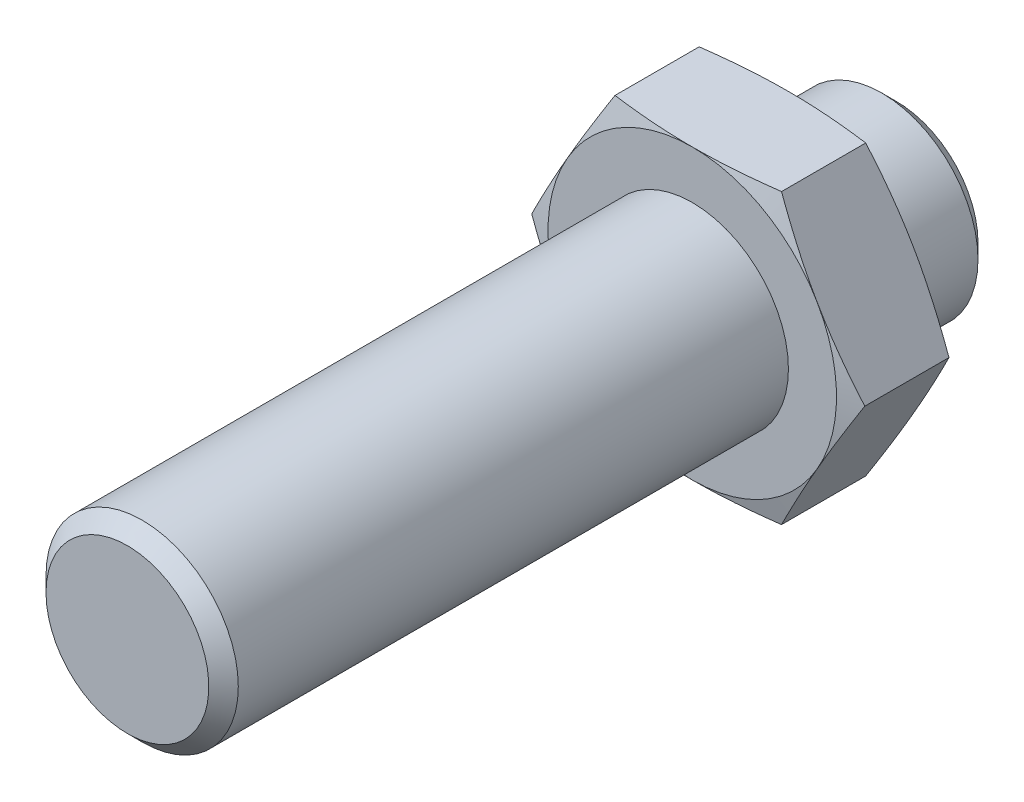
ISO-10303-21;
HEADER;
FILE_DESCRIPTION(('STEP AP214'),'2;1');
FILE_NAME('part.step','',(''),(''),'','','');
FILE_SCHEMA(('AUTOMOTIVE_DESIGN { 1 0 10303 214 1 1 1 1 }'));
ENDSEC;
DATA;
#1=APPLICATION_CONTEXT('core data for automotive mechanical design processes');
#2=APPLICATION_PROTOCOL_DEFINITION('international standard','automotive_design',2000,#1);
#3=PRODUCT_CONTEXT('',#1,'mechanical');
#4=PRODUCT('Part','Part','',(#3));
#5=PRODUCT_RELATED_PRODUCT_CATEGORY('part','',(#4));
#6=PRODUCT_DEFINITION_FORMATION('','',#4);
#7=PRODUCT_DEFINITION_CONTEXT('part definition',#1,'design');
#8=PRODUCT_DEFINITION('design','',#6,#7);
#9=PRODUCT_DEFINITION_SHAPE('','',#8);
#10=(LENGTH_UNIT() NAMED_UNIT(*) SI_UNIT(.MILLI.,.METRE.));
#11=(NAMED_UNIT(*) PLANE_ANGLE_UNIT() SI_UNIT($,.RADIAN.));
#12=(NAMED_UNIT(*) SI_UNIT($,.STERADIAN.) SOLID_ANGLE_UNIT());
#13=UNCERTAINTY_MEASURE_WITH_UNIT(LENGTH_MEASURE(1.E-05),#10,'distance_accuracy_value','');
#14=(GEOMETRIC_REPRESENTATION_CONTEXT(3) GLOBAL_UNCERTAINTY_ASSIGNED_CONTEXT((#13)) GLOBAL_UNIT_ASSIGNED_CONTEXT((#10,
#11,#12)) REPRESENTATION_CONTEXT('',''));
#15=CARTESIAN_POINT('',(0.,0.,0.));
#16=DIRECTION('',(0.,0.,1.));
#17=DIRECTION('',(1.,0.,0.));
#18=AXIS2_PLACEMENT_3D('',#15,#16,#17);
#19=CARTESIAN_POINT('',(0.,3.3865,0.));
#20=DIRECTION('',(0.,0.,1.));
#21=DIRECTION('',(1.,0.,0.));
#22=AXIS2_PLACEMENT_3D('',#19,#20,#21);
#23=PLANE('',#22);
#24=CARTESIAN_POINT('',(0.,0.,0.));
#25=DIRECTION('',(0.,0.,1.));
#26=DIRECTION('',(1.,0.,0.));
#27=AXIS2_PLACEMENT_3D('',#24,#25,#26);
#28=CIRCLE('',#27,3.38650000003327);
#29=CARTESIAN_POINT('',(3.38650000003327,0.,0.));
#30=VERTEX_POINT('',#29);
#31=EDGE_CURVE('E20',#30,#30,#28,.T.);
#32=ORIENTED_EDGE('',*,*,#31,.F.);
#33=EDGE_LOOP('',(#32));
#34=FACE_BOUND('',#33,.T.);
#35=ADVANCED_FACE('F17',(#34),#23,.F.);
#36=CARTESIAN_POINT('',(0.,0.,0.613499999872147));
#37=DIRECTION('',(0.,0.,1.));
#38=DIRECTION('',(1.,0.,0.));
#39=AXIS2_PLACEMENT_3D('',#36,#37,#38);
#40=CONICAL_SURFACE('',#39,3.99999999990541,0.785398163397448);
#41=CARTESIAN_POINT('',(0.,0.,0.613500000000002));
#42=DIRECTION('',(0.,0.,1.));
#43=DIRECTION('',(1.,0.,0.));
#44=AXIS2_PLACEMENT_3D('',#41,#42,#43);
#45=CIRCLE('',#44,4.);
#46=CARTESIAN_POINT('',(4.,0.,0.613500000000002));
#47=VERTEX_POINT('',#46);
#48=EDGE_CURVE('E371',#47,#47,#45,.T.);
#49=ORIENTED_EDGE('',*,*,#48,.F.);
#50=EDGE_LOOP('',(#49));
#51=FACE_BOUND('',#50,.T.);
#52=ORIENTED_EDGE('',*,*,#31,.T.);
#53=EDGE_LOOP('',(#52));
#54=FACE_BOUND('',#53,.T.);
#55=ADVANCED_FACE('F408',(#51,#54),#40,.T.);
#56=CARTESIAN_POINT('',(0.,0.,0.));
#57=DIRECTION('',(0.,0.,1.));
#58=DIRECTION('',(1.,0.,0.));
#59=AXIS2_PLACEMENT_3D('',#56,#57,#58);
#60=CYLINDRICAL_SURFACE('',#59,4.);
#61=CARTESIAN_POINT('',(0.,0.,4.5));
#62=DIRECTION('',(0.,0.,1.));
#63=DIRECTION('',(1.,0.,0.));
#64=AXIS2_PLACEMENT_3D('',#61,#62,#63);
#65=CIRCLE('',#64,4.);
#66=CARTESIAN_POINT('',(4.,0.,4.5));
#67=VERTEX_POINT('',#66);
#68=EDGE_CURVE('E125',#67,#67,#65,.F.);
#69=ORIENTED_EDGE('',*,*,#68,.T.);
#70=EDGE_LOOP('',(#69));
#71=FACE_BOUND('',#70,.T.);
#72=ORIENTED_EDGE('',*,*,#48,.T.);
#73=EDGE_LOOP('',(#72));
#74=FACE_BOUND('',#73,.T.);
#75=ADVANCED_FACE('F400',(#71,#74),#60,.T.);
#76=CARTESIAN_POINT('',(0.,4.,4.5));
#77=DIRECTION('',(0.,0.,1.));
#78=DIRECTION('',(1.,0.,0.));
#79=AXIS2_PLACEMENT_3D('',#76,#77,#78);
#80=PLANE('',#79);
#81=ORIENTED_EDGE('',*,*,#68,.F.);
#82=EDGE_LOOP('',(#81));
#83=FACE_BOUND('',#82,.T.);
#84=CARTESIAN_POINT('',(0.,0.,4.50000000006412));
#85=DIRECTION('',(0.,0.,1.));
#86=DIRECTION('',(1.,0.,0.));
#87=AXIS2_PLACEMENT_3D('',#84,#85,#86);
#88=CIRCLE('',#87,6.00000000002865);
#89=CARTESIAN_POINT('',(5.19615242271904,-3.00000000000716,4.50000000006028));
#90=VERTEX_POINT('',#89);
#91=CARTESIAN_POINT('',(5.19615242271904,3.00000000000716,4.50000000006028));
#92=VERTEX_POINT('',#91);
#93=EDGE_CURVE('E106',#90,#92,#88,.T.);
#94=ORIENTED_EDGE('',*,*,#93,.F.);
#95=CARTESIAN_POINT('',(0.,0.,4.50000000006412));
#96=DIRECTION('',(0.,0.,1.));
#97=DIRECTION('',(1.,0.,0.));
#98=AXIS2_PLACEMENT_3D('',#95,#96,#97);
#99=CIRCLE('',#98,6.00000000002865);
#100=CARTESIAN_POINT('',(0.,-6.00000000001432,4.50000000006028));
#101=VERTEX_POINT('',#100);
#102=EDGE_CURVE('E103',#101,#90,#99,.T.);
#103=ORIENTED_EDGE('',*,*,#102,.F.);
#104=CARTESIAN_POINT('',(0.,0.,4.50000000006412));
#105=DIRECTION('',(0.,0.,1.));
#106=DIRECTION('',(1.,0.,0.));
#107=AXIS2_PLACEMENT_3D('',#104,#105,#106);
#108=CIRCLE('',#107,6.00000000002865);
#109=CARTESIAN_POINT('',(-5.19615242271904,-3.00000000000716,4.50000000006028));
#110=VERTEX_POINT('',#109);
#111=EDGE_CURVE('E124',#110,#101,#108,.T.);
#112=ORIENTED_EDGE('',*,*,#111,.F.);
#113=CARTESIAN_POINT('',(0.,0.,4.50000000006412));
#114=DIRECTION('',(0.,0.,1.));
#115=DIRECTION('',(1.,0.,0.));
#116=AXIS2_PLACEMENT_3D('',#113,#114,#115);
#117=CIRCLE('',#116,6.00000000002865);
#118=CARTESIAN_POINT('',(-5.19615242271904,3.00000000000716,4.50000000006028));
#119=VERTEX_POINT('',#118);
#120=EDGE_CURVE('E393',#119,#110,#117,.T.);
#121=ORIENTED_EDGE('',*,*,#120,.F.);
#122=CARTESIAN_POINT('',(0.,0.,4.50000000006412));
#123=DIRECTION('',(0.,0.,1.));
#124=DIRECTION('',(1.,0.,0.));
#125=AXIS2_PLACEMENT_3D('',#122,#123,#124);
#126=CIRCLE('',#125,6.00000000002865);
#127=CARTESIAN_POINT('',(0.,6.00000000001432,4.50000000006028));
#128=VERTEX_POINT('',#127);
#129=EDGE_CURVE('E113',#128,#119,#126,.T.);
#130=ORIENTED_EDGE('',*,*,#129,.F.);
#131=CARTESIAN_POINT('',(0.,0.,4.50000000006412));
#132=DIRECTION('',(0.,0.,1.));
#133=DIRECTION('',(1.,0.,0.));
#134=AXIS2_PLACEMENT_3D('',#131,#132,#133);
#135=CIRCLE('',#134,6.00000000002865);
#136=EDGE_CURVE('E109',#92,#128,#135,.T.);
#137=ORIENTED_EDGE('',*,*,#136,.F.);
#138=EDGE_LOOP('',(#94,#103,#112,#121,#130,#137));
#139=FACE_BOUND('',#138,.T.);
#140=ADVANCED_FACE('F107',(#83,#139),#80,.F.);
#141=CARTESIAN_POINT('',(0.,0.,4.75020357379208));
#142=DIRECTION('',(0.,0.,1.));
#143=DIRECTION('',(1.,0.,0.));
#144=AXIS2_PLACEMENT_3D('',#141,#142,#143);
#145=CONICAL_SURFACE('',#144,6.93377244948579,1.30899693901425);
#146=CARTESIAN_POINT('',(0.,-6.,4.50000000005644));
#147=CARTESIAN_POINT('',(0.144925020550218,-6.,4.49999340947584));
#148=CARTESIAN_POINT('',(0.289845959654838,-6.,4.50140757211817));
#149=CARTESIAN_POINT('',(0.579629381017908,-6.,4.5070216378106));
#150=CARTESIAN_POINT('',(0.724491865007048,-6.,4.51122145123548));
#151=CARTESIAN_POINT('',(1.15859244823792,-6.,4.52790288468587));
#152=CARTESIAN_POINT('',(1.44768188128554,-6.,4.54446674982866));
#153=CARTESIAN_POINT('',(2.02502964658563,-6.,4.58746786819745));
#154=CARTESIAN_POINT('',(2.31328815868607,-6.,4.61390279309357));
#155=CARTESIAN_POINT('',(2.88923748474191,-6.,4.67527616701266));
#156=CARTESIAN_POINT('',(3.17692727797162,-6.,4.71022426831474));
#157=CARTESIAN_POINT('',(3.46410161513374,-6.,4.74871130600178));
#158=B_SPLINE_CURVE_WITH_KNOTS('',3,(#146,#147,#148,#149,#150,#151,#152,#153,#154,#155,#156,
#157),.UNSPECIFIED.,.F.,.F.,(4,2,2,2,2,4),(0.,0.434760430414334,0.869506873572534,
1.73798582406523,2.6062600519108,3.47552335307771),.UNSPECIFIED.);
#159=CARTESIAN_POINT('',(3.464101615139,-5.99999999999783,4.74871130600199));
#160=VERTEX_POINT('',#159);
#161=EDGE_CURVE('E122',#101,#160,#158,.T.);
#162=ORIENTED_EDGE('',*,*,#161,.F.);
#163=ORIENTED_EDGE('',*,*,#102,.T.);
#164=CARTESIAN_POINT('',(3.46410161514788,-6.00000000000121,4.74871130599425));
#165=CARTESIAN_POINT('',(3.60768878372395,-5.75129972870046,4.71022426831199));
#166=CARTESIAN_POINT('',(3.75153368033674,-5.5021530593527,4.67527616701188));
#167=CARTESIAN_POINT('',(4.03950834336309,-5.00336631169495,4.61390279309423));
#168=CARTESIAN_POINT('',(4.1836375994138,-4.75372711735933,4.5874678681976));
#169=CARTESIAN_POINT('',(4.47231148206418,-4.25372928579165,4.54446674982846));
#170=CARTESIAN_POINT('',(4.61685619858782,-4.00337049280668,4.52790288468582));
#171=CARTESIAN_POINT('',(4.83390649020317,-3.62742835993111,4.51122145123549));
#172=CARTESIAN_POINT('',(4.90633773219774,-3.50197376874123,4.5070216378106));
#173=CARTESIAN_POINT('',(5.05122944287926,-3.25101396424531,4.50140757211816));
#174=CARTESIAN_POINT('',(5.12368991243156,-3.12550874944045,4.49999340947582));
#175=CARTESIAN_POINT('',(5.19615242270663,-3.,4.50000000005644));
#176=B_SPLINE_CURVE_WITH_KNOTS('',3,(#164,#165,#166,#167,#168,#169,#170,#171,#172,#173,#174,
#175),.UNSPECIFIED.,.F.,.F.,(4,2,2,2,2,4),(0.,0.869263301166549,1.73753752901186,
2.60601647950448,3.04076292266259,3.47552335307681),.UNSPECIFIED.);
#177=EDGE_CURVE('E119',#160,#90,#176,.T.);
#178=ORIENTED_EDGE('',*,*,#177,.F.);
#179=EDGE_LOOP('',(#162,#163,#178));
#180=FACE_BOUND('',#179,.T.);
#181=ADVANCED_FACE('F117',(#180),#145,.T.);
#182=CARTESIAN_POINT('',(0.,0.,4.75020357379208));
#183=DIRECTION('',(0.,0.,1.));
#184=DIRECTION('',(1.,0.,0.));
#185=AXIS2_PLACEMENT_3D('',#182,#183,#184);
#186=CONICAL_SURFACE('',#185,6.93377244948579,1.30899693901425);
#187=CARTESIAN_POINT('',(-5.19615242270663,-3.,4.50000000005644));
#188=CARTESIAN_POINT('',(-5.12368991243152,-3.12550874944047,4.49999340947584));
#189=CARTESIAN_POINT('',(-5.05122944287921,-3.25101396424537,4.50140757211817));
#190=CARTESIAN_POINT('',(-4.90633773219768,-3.50197376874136,4.5070216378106));
#191=CARTESIAN_POINT('',(-4.83390649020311,-3.62742835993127,4.51122145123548));
#192=CARTESIAN_POINT('',(-4.61685619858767,-4.00337049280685,4.52790288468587));
#193=CARTESIAN_POINT('',(-4.47231148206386,-4.25372928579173,4.54446674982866));
#194=CARTESIAN_POINT('',(-4.18363759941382,-4.75372711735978,4.58746786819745));
#195=CARTESIAN_POINT('',(-4.03950834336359,-5.00336631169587,4.61390279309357));
#196=CARTESIAN_POINT('',(-3.75153368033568,-5.50215305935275,4.67527616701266));
#197=CARTESIAN_POINT('',(-3.60768878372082,-5.75129972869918,4.71022426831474));
#198=CARTESIAN_POINT('',(-3.46410161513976,-5.99999999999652,4.74871130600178));
#199=B_SPLINE_CURVE_WITH_KNOTS('',3,(#187,#188,#189,#190,#191,#192,#193,#194,#195,#196,#197,
#198),.UNSPECIFIED.,.F.,.F.,(4,2,2,2,2,4),(0.,0.434760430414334,0.869506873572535,
1.73798582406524,2.60626005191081,3.47552335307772),.UNSPECIFIED.);
#200=CARTESIAN_POINT('',(-3.46410161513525,-6.,4.74871130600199));
#201=VERTEX_POINT('',#200);
#202=EDGE_CURVE('E378',#110,#201,#199,.T.);
#203=ORIENTED_EDGE('',*,*,#202,.F.);
#204=ORIENTED_EDGE('',*,*,#111,.T.);
#205=CARTESIAN_POINT('',(-3.46410161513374,-6.00000000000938,4.74871130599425));
#206=CARTESIAN_POINT('',(-3.17692727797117,-6.00000000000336,4.71022426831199));
#207=CARTESIAN_POINT('',(-2.88923748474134,-6.0000000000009,4.67527616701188));
#208=CARTESIAN_POINT('',(-2.31328815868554,-5.9999999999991,4.61390279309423));
#209=CARTESIAN_POINT('',(-2.02502964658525,-5.99999999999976,4.5874678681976));
#210=CARTESIAN_POINT('',(-1.44768188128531,-6.00000000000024,4.54446674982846));
#211=CARTESIAN_POINT('',(-1.1585924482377,-6.00000000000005,4.52790288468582));
#212=CARTESIAN_POINT('',(-0.724491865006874,-5.99999999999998,4.51122145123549));
#213=CARTESIAN_POINT('',(-0.579629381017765,-5.99999999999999,4.5070216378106));
#214=CARTESIAN_POINT('',(-0.289845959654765,-6.00000000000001,4.50140757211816));
#215=CARTESIAN_POINT('',(-0.144925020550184,-6.00000000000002,4.49999340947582));
#216=CARTESIAN_POINT('',(0.,-6.,4.50000000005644));
#217=B_SPLINE_CURVE_WITH_KNOTS('',3,(#205,#206,#207,#208,#209,#210,#211,#212,#213,#214,#215,
#216),.UNSPECIFIED.,.F.,.F.,(4,2,2,2,2,4),(0.,0.869263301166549,1.73753752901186,
2.60601647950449,3.0407629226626,3.47552335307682),.UNSPECIFIED.);
#218=EDGE_CURVE('E134',#201,#101,#217,.T.);
#219=ORIENTED_EDGE('',*,*,#218,.F.);
#220=EDGE_LOOP('',(#203,#204,#219));
#221=FACE_BOUND('',#220,.T.);
#222=ADVANCED_FACE('F158',(#221),#186,.T.);
#223=CARTESIAN_POINT('',(0.,0.,4.75020357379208));
#224=DIRECTION('',(0.,0.,1.));
#225=DIRECTION('',(1.,0.,0.));
#226=AXIS2_PLACEMENT_3D('',#223,#224,#225);
#227=CONICAL_SURFACE('',#226,6.93377244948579,1.30899693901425);
#228=ORIENTED_EDGE('',*,*,#120,.T.);
#229=CARTESIAN_POINT('',(-6.92820323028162,-8.16341725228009E-12,4.74871130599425));
#230=CARTESIAN_POINT('',(-6.78461606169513,-0.248700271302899,4.71022426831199));
#231=CARTESIAN_POINT('',(-6.64077116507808,-0.497846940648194,4.67527616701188));
#232=CARTESIAN_POINT('',(-6.35279650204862,-0.996633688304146,4.61390279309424));
#233=CARTESIAN_POINT('',(-6.20866724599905,-1.24627288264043,4.5874678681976));
#234=CARTESIAN_POINT('',(-5.91999336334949,-1.74627071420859,4.54446674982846));
#235=CARTESIAN_POINT('',(-5.77544864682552,-1.99662950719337,4.52790288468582));
#236=CARTESIAN_POINT('',(-5.55839835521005,-2.37257164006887,4.51122145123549));
#237=CARTESIAN_POINT('',(-5.48596711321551,-2.49802623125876,4.5070216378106));
#238=CARTESIAN_POINT('',(-5.34107540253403,-2.7489860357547,4.50140757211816));
#239=CARTESIAN_POINT('',(-5.26861493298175,-2.87449125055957,4.49999340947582));
#240=CARTESIAN_POINT('',(-5.19615242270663,-3.,4.50000000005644));
#241=B_SPLINE_CURVE_WITH_KNOTS('',3,(#229,#230,#231,#232,#233,#234,#235,#236,#237,#238,#239,
#240),.UNSPECIFIED.,.F.,.F.,(4,2,2,2,2,4),(0.,0.869263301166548,1.73753752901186,
2.60601647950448,3.04076292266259,3.47552335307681),.UNSPECIFIED.);
#242=CARTESIAN_POINT('',(-6.92820323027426,-2.16671186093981E-12,4.74871130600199));
#243=VERTEX_POINT('',#242);
#244=EDGE_CURVE('E168',#243,#110,#241,.T.);
#245=ORIENTED_EDGE('',*,*,#244,.F.);
#246=CARTESIAN_POINT('',(-5.19615242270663,3.,4.50000000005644));
#247=CARTESIAN_POINT('',(-5.26861493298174,2.87449125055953,4.49999340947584));
#248=CARTESIAN_POINT('',(-5.34107540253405,2.74898603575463,4.50140757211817));
#249=CARTESIAN_POINT('',(-5.48596711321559,2.49802623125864,4.5070216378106));
#250=CARTESIAN_POINT('',(-5.55839835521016,2.37257164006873,4.51122145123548));
#251=CARTESIAN_POINT('',(-5.77544864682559,1.99662950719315,4.52790288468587));
#252=CARTESIAN_POINT('',(-5.9199933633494,1.74627071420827,4.54446674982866));
#253=CARTESIAN_POINT('',(-6.20866724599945,1.24627288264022,4.58746786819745));
#254=CARTESIAN_POINT('',(-6.35279650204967,0.996633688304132,4.61390279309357));
#255=CARTESIAN_POINT('',(-6.64077116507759,0.497846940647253,4.67527616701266));
#256=CARTESIAN_POINT('',(-6.78461606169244,0.248700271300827,4.71022426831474));
#257=CARTESIAN_POINT('',(-6.9282032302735,3.47812675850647E-12,4.74871130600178));
#258=B_SPLINE_CURVE_WITH_KNOTS('',3,(#246,#247,#248,#249,#250,#251,#252,#253,#254,#255,#256,
#257),.UNSPECIFIED.,.F.,.F.,(4,2,2,2,2,4),(0.,0.434760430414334,0.869506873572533,
1.73798582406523,2.6062600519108,3.47552335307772),.UNSPECIFIED.);
#259=EDGE_CURVE('E267',#119,#243,#258,.T.);
#260=ORIENTED_EDGE('',*,*,#259,.F.);
#261=EDGE_LOOP('',(#228,#245,#260));
#262=FACE_BOUND('',#261,.T.);
#263=ADVANCED_FACE('F501',(#262),#227,.T.);
#264=CARTESIAN_POINT('',(0.,0.,4.75020357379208));
#265=DIRECTION('',(0.,0.,1.));
#266=DIRECTION('',(1.,0.,0.));
#267=AXIS2_PLACEMENT_3D('',#264,#265,#266);
#268=CONICAL_SURFACE('',#267,6.93377244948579,1.30899693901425);
#269=ORIENTED_EDGE('',*,*,#129,.T.);
#270=CARTESIAN_POINT('',(-3.46410161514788,6.00000000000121,4.74871130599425));
#271=CARTESIAN_POINT('',(-3.60768878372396,5.75129972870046,4.71022426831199));
#272=CARTESIAN_POINT('',(-3.75153368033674,5.5021530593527,4.67527616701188));
#273=CARTESIAN_POINT('',(-4.03950834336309,5.00336631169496,4.61390279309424));
#274=CARTESIAN_POINT('',(-4.1836375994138,4.75372711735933,4.5874678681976));
#275=CARTESIAN_POINT('',(-4.47231148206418,4.25372928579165,4.54446674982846));
#276=CARTESIAN_POINT('',(-4.61685619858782,4.00337049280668,4.52790288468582));
#277=CARTESIAN_POINT('',(-4.83390649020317,3.62742835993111,4.51122145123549));
#278=CARTESIAN_POINT('',(-4.90633773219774,3.50197376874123,4.5070216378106));
#279=CARTESIAN_POINT('',(-5.05122944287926,3.25101396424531,4.50140757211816));
#280=CARTESIAN_POINT('',(-5.12368991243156,3.12550874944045,4.49999340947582));
#281=CARTESIAN_POINT('',(-5.19615242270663,3.,4.50000000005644));
#282=B_SPLINE_CURVE_WITH_KNOTS('',3,(#270,#271,#272,#273,#274,#275,#276,#277,#278,#279,#280,
#281),.UNSPECIFIED.,.F.,.F.,(4,2,2,2,2,4),(0.,0.869263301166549,1.73753752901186,
2.60601647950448,3.04076292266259,3.47552335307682),.UNSPECIFIED.);
#283=CARTESIAN_POINT('',(-3.464101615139,5.99999999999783,4.74871130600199));
#284=VERTEX_POINT('',#283);
#285=EDGE_CURVE('E377',#284,#119,#282,.T.);
#286=ORIENTED_EDGE('',*,*,#285,.F.);
#287=CARTESIAN_POINT('',(0.,6.,4.50000000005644));
#288=CARTESIAN_POINT('',(-0.144925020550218,6.,4.49999340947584));
#289=CARTESIAN_POINT('',(-0.289845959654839,6.,4.50140757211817));
#290=CARTESIAN_POINT('',(-0.579629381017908,6.,4.5070216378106));
#291=CARTESIAN_POINT('',(-0.724491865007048,6.,4.51122145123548));
#292=CARTESIAN_POINT('',(-1.15859244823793,6.,4.52790288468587));
#293=CARTESIAN_POINT('',(-1.44768188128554,6.,4.54446674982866));
#294=CARTESIAN_POINT('',(-2.02502964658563,6.,4.58746786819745));
#295=CARTESIAN_POINT('',(-2.31328815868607,6.,4.61390279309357));
#296=CARTESIAN_POINT('',(-2.88923748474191,6.,4.67527616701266));
#297=CARTESIAN_POINT('',(-3.17692727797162,6.,4.71022426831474));
#298=CARTESIAN_POINT('',(-3.46410161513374,6.,4.74871130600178));
#299=B_SPLINE_CURVE_WITH_KNOTS('',3,(#287,#288,#289,#290,#291,#292,#293,#294,#295,#296,#297,
#298),.UNSPECIFIED.,.F.,.F.,(4,2,2,2,2,4),(0.,0.434760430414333,0.869506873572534,
1.73798582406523,2.6062600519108,3.47552335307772),.UNSPECIFIED.);
#300=EDGE_CURVE('E262',#128,#284,#299,.T.);
#301=ORIENTED_EDGE('',*,*,#300,.F.);
#302=EDGE_LOOP('',(#269,#286,#301));
#303=FACE_BOUND('',#302,.T.);
#304=ADVANCED_FACE('F495',(#303),#268,.T.);
#305=CARTESIAN_POINT('',(0.,0.,4.75020357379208));
#306=DIRECTION('',(0.,0.,1.));
#307=DIRECTION('',(1.,0.,0.));
#308=AXIS2_PLACEMENT_3D('',#305,#306,#307);
#309=CONICAL_SURFACE('',#308,6.93377244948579,1.30899693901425);
#310=ORIENTED_EDGE('',*,*,#93,.T.);
#311=CARTESIAN_POINT('',(6.92820323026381,1.27161662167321E-11,4.74871130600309));
#312=CARTESIAN_POINT('',(6.78461606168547,0.248700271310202,4.71022426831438));
#313=CARTESIAN_POINT('',(6.64077116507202,0.497846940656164,4.67527616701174));
#314=CARTESIAN_POINT('',(6.35279650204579,0.996633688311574,4.61390279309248));
#315=CARTESIAN_POINT('',(6.20866724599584,1.24627288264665,4.58746786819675));
#316=CARTESIAN_POINT('',(5.91999336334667,1.74627071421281,4.54446674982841));
#317=CARTESIAN_POINT('',(5.77544864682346,1.9966295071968,4.52790288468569));
#318=CARTESIAN_POINT('',(5.55839835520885,2.37257164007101,4.51122145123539));
#319=CARTESIAN_POINT('',(5.48596711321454,2.49802623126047,4.50702163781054));
#320=CARTESIAN_POINT('',(5.34107540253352,2.74898603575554,4.50140757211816));
#321=CARTESIAN_POINT('',(5.26861493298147,2.87449125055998,4.49999340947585));
#322=CARTESIAN_POINT('',(5.19615242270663,3.,4.50000000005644));
#323=B_SPLINE_CURVE_WITH_KNOTS('',3,(#311,#312,#313,#314,#315,#316,#317,#318,#319,#320,#321,
#322),.UNSPECIFIED.,.F.,.F.,(4,2,2,2,2,4),(0.,0.869263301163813,1.73753752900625,
2.60601647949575,3.04076292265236,3.47552335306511),.UNSPECIFIED.);
#324=CARTESIAN_POINT('',(6.92820323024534,0.,4.74871130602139));
#325=VERTEX_POINT('',#324);
#326=EDGE_CURVE('E131',#325,#92,#323,.T.);
#327=ORIENTED_EDGE('',*,*,#326,.F.);
#328=CARTESIAN_POINT('',(5.19615242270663,-3.,4.50000000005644));
#329=CARTESIAN_POINT('',(5.26861493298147,-2.87449125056,4.49999340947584));
#330=CARTESIAN_POINT('',(5.34107540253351,-2.74898603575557,4.50140757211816));
#331=CARTESIAN_POINT('',(5.4859671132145,-2.49802623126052,4.50702163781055));
#332=CARTESIAN_POINT('',(5.5583983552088,-2.37257164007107,4.51122145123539));
#333=CARTESIAN_POINT('',(5.77544864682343,-1.99662950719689,4.52790288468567));
#334=CARTESIAN_POINT('',(5.91999336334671,-1.74627071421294,4.54446674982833));
#335=CARTESIAN_POINT('',(6.20866724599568,-1.24627288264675,4.58746786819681));
#336=CARTESIAN_POINT('',(6.35279650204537,-0.996633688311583,4.61390279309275));
#337=CARTESIAN_POINT('',(6.64077116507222,-0.497846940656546,4.67527616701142));
#338=CARTESIAN_POINT('',(6.78461606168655,-0.248700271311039,4.71022426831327));
#339=CARTESIAN_POINT('',(6.92820323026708,-1.46054919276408E-11,4.74871130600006));
#340=B_SPLINE_CURVE_WITH_KNOTS('',3,(#328,#329,#330,#331,#332,#333,#334,#335,#336,#337,#338,
#339),.UNSPECIFIED.,.F.,.F.,(4,2,2,2,2,4),(0.,0.43476043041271,0.869506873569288,
1.73798582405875,2.60626005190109,3.47552335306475),.UNSPECIFIED.);
#341=EDGE_CURVE('E128',#90,#325,#340,.T.);
#342=ORIENTED_EDGE('',*,*,#341,.F.);
#343=EDGE_LOOP('',(#310,#327,#342));
#344=FACE_BOUND('',#343,.T.);
#345=ADVANCED_FACE('F129',(#344),#309,.T.);
#346=CARTESIAN_POINT('',(0.,0.,4.75020357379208));
#347=DIRECTION('',(0.,0.,1.));
#348=DIRECTION('',(1.,0.,0.));
#349=AXIS2_PLACEMENT_3D('',#346,#347,#348);
#350=CONICAL_SURFACE('',#349,6.93377244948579,1.30899693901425);
#351=ORIENTED_EDGE('',*,*,#136,.T.);
#352=CARTESIAN_POINT('',(3.46410161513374,6.00000000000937,4.74871130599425));
#353=CARTESIAN_POINT('',(3.17692727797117,6.00000000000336,4.71022426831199));
#354=CARTESIAN_POINT('',(2.88923748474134,6.0000000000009,4.67527616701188));
#355=CARTESIAN_POINT('',(2.31328815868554,5.9999999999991,4.61390279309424));
#356=CARTESIAN_POINT('',(2.02502964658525,5.99999999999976,4.5874678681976));
#357=CARTESIAN_POINT('',(1.44768188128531,6.00000000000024,4.54446674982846));
#358=CARTESIAN_POINT('',(1.1585924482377,6.00000000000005,4.52790288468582));
#359=CARTESIAN_POINT('',(0.724491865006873,5.99999999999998,4.51122145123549));
#360=CARTESIAN_POINT('',(0.579629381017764,5.99999999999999,4.5070216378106));
#361=CARTESIAN_POINT('',(0.289845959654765,6.00000000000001,4.50140757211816));
#362=CARTESIAN_POINT('',(0.144925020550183,6.00000000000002,4.49999340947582));
#363=CARTESIAN_POINT('',(0.,6.,4.50000000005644));
#364=B_SPLINE_CURVE_WITH_KNOTS('',3,(#352,#353,#354,#355,#356,#357,#358,#359,#360,#361,#362,
#363),.UNSPECIFIED.,.F.,.F.,(4,2,2,2,2,4),(0.,0.869263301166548,1.73753752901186,
2.60601647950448,3.0407629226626,3.47552335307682),.UNSPECIFIED.);
#365=CARTESIAN_POINT('',(3.46410161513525,6.,4.74871130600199));
#366=VERTEX_POINT('',#365);
#367=EDGE_CURVE('E256',#366,#128,#364,.T.);
#368=ORIENTED_EDGE('',*,*,#367,.F.);
#369=CARTESIAN_POINT('',(5.19615242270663,3.,4.50000000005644));
#370=CARTESIAN_POINT('',(5.12368991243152,3.12550874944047,4.49999340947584));
#371=CARTESIAN_POINT('',(5.05122944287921,3.25101396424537,4.50140757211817));
#372=CARTESIAN_POINT('',(4.90633773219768,3.50197376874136,4.5070216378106));
#373=CARTESIAN_POINT('',(4.83390649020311,3.62742835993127,4.51122145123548));
#374=CARTESIAN_POINT('',(4.61685619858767,4.00337049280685,4.52790288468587));
#375=CARTESIAN_POINT('',(4.47231148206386,4.25372928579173,4.54446674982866));
#376=CARTESIAN_POINT('',(4.18363759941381,4.75372711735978,4.58746786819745));
#377=CARTESIAN_POINT('',(4.03950834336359,5.00336631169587,4.61390279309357));
#378=CARTESIAN_POINT('',(3.75153368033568,5.50215305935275,4.67527616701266));
#379=CARTESIAN_POINT('',(3.60768878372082,5.75129972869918,4.71022426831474));
#380=CARTESIAN_POINT('',(3.46410161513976,5.99999999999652,4.74871130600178));
#381=B_SPLINE_CURVE_WITH_KNOTS('',3,(#369,#370,#371,#372,#373,#374,#375,#376,#377,#378,#379,
#380),.UNSPECIFIED.,.F.,.F.,(4,2,2,2,2,4),(0.,0.434760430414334,0.869506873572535,
1.73798582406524,2.60626005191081,3.47552335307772),.UNSPECIFIED.);
#382=EDGE_CURVE('E237',#92,#366,#381,.T.);
#383=ORIENTED_EDGE('',*,*,#382,.F.);
#384=EDGE_LOOP('',(#351,#368,#383));
#385=FACE_BOUND('',#384,.T.);
#386=ADVANCED_FACE('F248',(#385),#350,.T.);
#387=CARTESIAN_POINT('',(3.46410161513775,-6.,4.5));
#388=DIRECTION('',(0.866025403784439,-0.5,0.));
#389=DIRECTION('',(0.5,0.866025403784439,0.));
#390=AXIS2_PLACEMENT_3D('',#387,#388,#389);
#391=PLANE('',#390);
#392=CARTESIAN_POINT('',(3.46410166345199,-5.99999991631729,8.25128870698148));
#393=CARTESIAN_POINT('',(3.60768882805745,-5.75129965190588,8.28977574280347));
#394=CARTESIAN_POINT('',(3.75153372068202,-5.50215298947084,8.32472384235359));
#395=CARTESIAN_POINT('',(4.03950837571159,-5.0033662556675,8.38609721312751));
#396=CARTESIAN_POINT('',(4.18363762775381,-4.75372706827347,8.4125321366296));
#397=CARTESIAN_POINT('',(4.4723115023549,-4.25372925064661,8.4555332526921));
#398=CARTESIAN_POINT('',(4.61685621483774,-4.0033704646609,8.47209711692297));
#399=CARTESIAN_POINT('',(4.83390650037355,-3.62742834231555,8.48877854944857));
#400=CARTESIAN_POINT('',(4.9063377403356,-3.50197375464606,8.49297836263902));
#401=CARTESIAN_POINT('',(5.05122944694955,-3.25101395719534,8.49859242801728));
#402=CARTESIAN_POINT('',(5.12368991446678,-3.1255087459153,8.50000659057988));
#403=CARTESIAN_POINT('',(5.19615242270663,-3.,8.5));
#404=B_SPLINE_CURVE_WITH_KNOTS('',3,(#392,#393,#394,#395,#396,#397,#398,#399,#400,#401,#402,
#403),.UNSPECIFIED.,.F.,.F.,(4,2,2,2,2,4),(0.,0.869263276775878,1.73753748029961,
2.60601640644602,3.04076283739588,3.47552325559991),.UNSPECIFIED.);
#405=CARTESIAN_POINT('',(3.46410163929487,-5.99999995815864,8.2512887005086));
#406=VERTEX_POINT('',#405);
#407=CARTESIAN_POINT('',(5.19615242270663,-3.,8.5));
#408=VERTEX_POINT('',#407);
#409=EDGE_CURVE('E202',#406,#408,#404,.T.);
#410=ORIENTED_EDGE('',*,*,#409,.F.);
#411=DIRECTION('',(0.,0.,-1.));
#412=VECTOR('',#411,1.);
#413=CARTESIAN_POINT('',(3.46410161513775,-6.,4.5));
#414=LINE('',#413,#412);
#415=EDGE_CURVE('E138',#160,#406,#414,.F.);
#416=ORIENTED_EDGE('',*,*,#415,.F.);
#417=ORIENTED_EDGE('',*,*,#177,.T.);
#418=ORIENTED_EDGE('',*,*,#341,.T.);
#419=DIRECTION('',(0.,0.,1.));
#420=VECTOR('',#419,1.);
#421=CARTESIAN_POINT('',(6.92820323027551,0.,4.5));
#422=LINE('',#421,#420);
#423=CARTESIAN_POINT('',(6.92820320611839,4.18413613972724E-08,8.2512887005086));
#424=VERTEX_POINT('',#423);
#425=EDGE_CURVE('E236',#424,#325,#422,.F.);
#426=ORIENTED_EDGE('',*,*,#425,.F.);
#427=CARTESIAN_POINT('',(5.19615242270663,-3.,8.5));
#428=CARTESIAN_POINT('',(5.26861493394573,-2.87449124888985,8.50000659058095));
#429=CARTESIAN_POINT('',(5.34107540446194,-2.74898603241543,8.4985924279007));
#430=CARTESIAN_POINT('',(5.48596711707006,-2.4980262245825,8.49297836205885));
#431=CARTESIAN_POINT('',(5.55839836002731,-2.37257163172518,8.48877854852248));
#432=CARTESIAN_POINT('',(5.77544865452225,-1.99662949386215,8.47209711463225));
#433=CARTESIAN_POINT('',(5.91999337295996,-1.7462706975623,8.45553324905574));
#434=CARTESIAN_POINT('',(6.20866725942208,-1.24627285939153,8.41253212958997));
#435=CARTESIAN_POINT('',(6.3527965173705,-0.99663366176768,8.38609720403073));
#436=CARTESIAN_POINT('',(6.64077118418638,-0.497846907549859,8.32472382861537));
#437=CARTESIAN_POINT('',(6.78461608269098,-0.248700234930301,8.28977572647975));
#438=CARTESIAN_POINT('',(6.92820325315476,3.96280321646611E-08,8.25128868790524));
#439=B_SPLINE_CURVE_WITH_KNOTS('',3,(#427,#428,#429,#430,#431,#432,#433,#434,#435,#436,#437,
#438),.UNSPECIFIED.,.F.,.F.,(4,2,2,2,2,4),(0.,0.434760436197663,0.869506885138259,
1.73798584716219,2.60626008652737,3.47552339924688),.UNSPECIFIED.);
#440=EDGE_CURVE('E225',#408,#424,#439,.T.);
#441=ORIENTED_EDGE('',*,*,#440,.F.);
#442=EDGE_LOOP('',(#410,#416,#417,#418,#426,#441));
#443=FACE_BOUND('',#442,.T.);
#444=ADVANCED_FACE('F136',(#443),#391,.T.);
#445=CARTESIAN_POINT('',(-3.46410161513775,-6.,4.5));
#446=DIRECTION('',(0.,-1.,0.));
#447=DIRECTION('',(0.,0.,-1.));
#448=AXIS2_PLACEMENT_3D('',#445,#446,#447);
#449=PLANE('',#448);
#450=CARTESIAN_POINT('',(-3.46410151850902,-6.,8.25128870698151));
#451=CARTESIAN_POINT('',(-3.17692718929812,-6.,8.2897757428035));
#452=CARTESIAN_POINT('',(-2.88923740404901,-6.,8.32472384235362));
#453=CARTESIAN_POINT('',(-2.31328809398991,-6.,8.38609721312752));
#454=CARTESIAN_POINT('',(-2.02502958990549,-6.,8.41253213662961));
#455=CARTESIAN_POINT('',(-1.44768184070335,-6.,8.45553325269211));
#456=CARTESIAN_POINT('',(-1.15859241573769,-6.,8.47209711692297));
#457=CARTESIAN_POINT('',(-0.724491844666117,-6.,8.48877854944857));
#458=CARTESIAN_POINT('',(-0.579629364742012,-6.,8.49297836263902));
#459=CARTESIAN_POINT('',(-0.289845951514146,-6.,8.49859242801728));
#460=CARTESIAN_POINT('',(-0.144925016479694,-6.,8.50000659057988));
#461=CARTESIAN_POINT('',(0.,-6.,8.5));
#462=B_SPLINE_CURVE_WITH_KNOTS('',3,(#450,#451,#452,#453,#454,#455,#456,#457,#458,#459,#460,
#461),.UNSPECIFIED.,.F.,.F.,(4,2,2,2,2,4),(0.,0.869263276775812,1.73753748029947,
2.60601640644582,3.04076283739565,3.47552325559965),.UNSPECIFIED.);
#463=CARTESIAN_POINT('',(-3.46410156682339,-6.,8.25128870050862));
#464=VERTEX_POINT('',#463);
#465=CARTESIAN_POINT('',(0.,-6.,8.5));
#466=VERTEX_POINT('',#465);
#467=EDGE_CURVE('E188',#464,#466,#462,.T.);
#468=ORIENTED_EDGE('',*,*,#467,.F.);
#469=DIRECTION('',(0.,0.,1.));
#470=VECTOR('',#469,1.);
#471=CARTESIAN_POINT('',(-3.46410161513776,-6.,4.5));
#472=LINE('',#471,#470);
#473=EDGE_CURVE('E375',#201,#464,#472,.T.);
#474=ORIENTED_EDGE('',*,*,#473,.F.);
#475=ORIENTED_EDGE('',*,*,#218,.T.);
#476=ORIENTED_EDGE('',*,*,#161,.T.);
#477=ORIENTED_EDGE('',*,*,#415,.T.);
#478=CARTESIAN_POINT('',(0.,-6.,8.5));
#479=CARTESIAN_POINT('',(0.144925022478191,-6.,8.50000659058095));
#480=CARTESIAN_POINT('',(0.289845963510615,-6.,8.4985924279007));
#481=CARTESIAN_POINT('',(0.579629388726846,-6.,8.49297836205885));
#482=CARTESIAN_POINT('',(0.724491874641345,-6.,8.48877854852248));
#483=CARTESIAN_POINT('',(1.15859246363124,-6.,8.47209711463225));
#484=CARTESIAN_POINT('',(1.44768190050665,-6.,8.45553324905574));
#485=CARTESIAN_POINT('',(2.0250296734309,-6.,8.41253212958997));
#486=CARTESIAN_POINT('',(2.31328818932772,-6.,8.38609720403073));
#487=CARTESIAN_POINT('',(2.88923752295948,-6.,8.32472382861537));
#488=CARTESIAN_POINT('',(3.17692731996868,-6.,8.28977572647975));
#489=CARTESIAN_POINT('',(3.46410166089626,-6.,8.25128868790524));
#490=B_SPLINE_CURVE_WITH_KNOTS('',3,(#478,#479,#480,#481,#482,#483,#484,#485,#486,#487,#488,
#489),.UNSPECIFIED.,.F.,.F.,(4,2,2,2,2,4),(0.,0.434760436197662,0.869506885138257,
1.73798584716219,2.60626008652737,3.47552339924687),.UNSPECIFIED.);
#491=EDGE_CURVE('E195',#466,#406,#490,.T.);
#492=ORIENTED_EDGE('',*,*,#491,.F.);
#493=EDGE_LOOP('',(#468,#474,#475,#476,#477,#492));
#494=FACE_BOUND('',#493,.T.);
#495=ADVANCED_FACE('F177',(#494),#449,.T.);
#496=CARTESIAN_POINT('',(-6.92820323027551,0.,4.5));
#497=DIRECTION('',(-0.866025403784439,-0.5,0.));
#498=DIRECTION('',(0.5,-0.866025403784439,0.));
#499=AXIS2_PLACEMENT_3D('',#496,#497,#498);
#500=PLANE('',#499);
#501=CARTESIAN_POINT('',(-6.92820323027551,0.,8.25128869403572));
#502=CARTESIAN_POINT('',(-6.7846160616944,-0.248700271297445,8.28977573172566));
#503=CARTESIAN_POINT('',(-6.64077116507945,-0.497846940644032,8.32472383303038));
#504=CARTESIAN_POINT('',(-6.3527965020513,-0.996633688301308,8.38609720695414));
#505=CARTESIAN_POINT('',(-6.20866724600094,-1.24627288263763,8.41253213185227));
#506=CARTESIAN_POINT('',(-5.91999336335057,-1.74627071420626,8.45553325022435));
#507=CARTESIAN_POINT('',(-5.77544864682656,-1.99662950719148,8.47209711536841));
#508=CARTESIAN_POINT('',(-5.55839835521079,-2.37257164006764,8.4887785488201));
#509=CARTESIAN_POINT('',(-5.48596711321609,-2.49802623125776,8.4929783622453));
#510=CARTESIAN_POINT('',(-5.34107540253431,-2.74898603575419,8.49859242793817));
#511=CARTESIAN_POINT('',(-5.26861493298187,-2.87449125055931,8.50000659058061));
#512=CARTESIAN_POINT('',(-5.19615242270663,-3.,8.5));
#513=B_SPLINE_CURVE_WITH_KNOTS('',3,(#501,#502,#503,#504,#505,#506,#507,#508,#509,#510,#511,
#512),.UNSPECIFIED.,.F.,.F.,(4,2,2,2,2,4),(0.,0.869263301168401,1.73753752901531,
2.60601647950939,3.04076292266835,3.47552335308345),.UNSPECIFIED.);
#514=CARTESIAN_POINT('',(-6.92820323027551,0.,8.25128869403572));
#515=VERTEX_POINT('',#514);
#516=CARTESIAN_POINT('',(-5.19615242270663,-3.,8.5));
#517=VERTEX_POINT('',#516);
#518=EDGE_CURVE('E316',#515,#517,#513,.T.);
#519=ORIENTED_EDGE('',*,*,#518,.F.);
#520=DIRECTION('',(0.,0.,1.));
#521=VECTOR('',#520,1.);
#522=CARTESIAN_POINT('',(-6.92820323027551,0.,4.5));
#523=LINE('',#522,#521);
#524=EDGE_CURVE('E263',#243,#515,#523,.T.);
#525=ORIENTED_EDGE('',*,*,#524,.F.);
#526=ORIENTED_EDGE('',*,*,#244,.T.);
#527=ORIENTED_EDGE('',*,*,#202,.T.);
#528=ORIENTED_EDGE('',*,*,#473,.T.);
#529=CARTESIAN_POINT('',(-5.19615242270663,-3.,8.5));
#530=CARTESIAN_POINT('',(-5.12368991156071,-3.12550875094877,8.50000659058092));
#531=CARTESIAN_POINT('',(-5.05122944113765,-3.25101396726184,8.49859242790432));
#532=CARTESIAN_POINT('',(-4.90633772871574,-3.50197377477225,8.49297836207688));
#533=CARTESIAN_POINT('',(-4.83390648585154,-3.62742836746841,8.48877854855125));
#534=CARTESIAN_POINT('',(-4.6168561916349,-4.00337050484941,8.47209711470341));
#535=CARTESIAN_POINT('',(-4.47231147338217,-4.25372930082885,8.4555332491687));
#536=CARTESIAN_POINT('',(-4.1836375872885,-4.75372713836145,8.41253212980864));
#537=CARTESIAN_POINT('',(-4.03950832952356,-5.00336633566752,8.38609720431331));
#538=CARTESIAN_POINT('',(-3.75153366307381,-5.50215308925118,8.32472382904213));
#539=CARTESIAN_POINT('',(-3.60768876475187,-5.75129976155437,8.28977572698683));
#540=CARTESIAN_POINT('',(-3.46410159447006,-6.0000000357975,8.25128868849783));
#541=B_SPLINE_CURVE_WITH_KNOTS('',3,(#529,#530,#531,#532,#533,#534,#535,#536,#537,#538,#539,
#540),.UNSPECIFIED.,.F.,.F.,(4,2,2,2,2,4),(0.,0.434760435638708,0.869506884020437,
1.73798584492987,2.60626008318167,3.47552339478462),.UNSPECIFIED.);
#542=EDGE_CURVE('E321',#517,#464,#541,.T.);
#543=ORIENTED_EDGE('',*,*,#542,.F.);
#544=EDGE_LOOP('',(#519,#525,#526,#527,#528,#543));
#545=FACE_BOUND('',#544,.T.);
#546=ADVANCED_FACE('F180',(#545),#500,.T.);
#547=CARTESIAN_POINT('',(-3.46410161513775,6.,4.5));
#548=DIRECTION('',(-0.866025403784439,0.5,0.));
#549=DIRECTION('',(-0.5,-0.866025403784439,0.));
#550=AXIS2_PLACEMENT_3D('',#547,#548,#549);
#551=PLANE('',#550);
#552=CARTESIAN_POINT('',(-3.46410166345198,5.9999999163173,8.25128870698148));
#553=CARTESIAN_POINT('',(-3.60768882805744,5.75129965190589,8.28977574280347));
#554=CARTESIAN_POINT('',(-3.75153372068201,5.50215298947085,8.32472384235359));
#555=CARTESIAN_POINT('',(-4.03950837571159,5.0033662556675,8.38609721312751));
#556=CARTESIAN_POINT('',(-4.18363762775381,4.75372706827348,8.4125321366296));
#557=CARTESIAN_POINT('',(-4.4723115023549,4.25372925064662,8.4555332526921));
#558=CARTESIAN_POINT('',(-4.61685621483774,4.0033704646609,8.47209711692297));
#559=CARTESIAN_POINT('',(-4.83390650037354,3.62742834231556,8.48877854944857));
#560=CARTESIAN_POINT('',(-4.9063377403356,3.50197375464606,8.49297836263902));
#561=CARTESIAN_POINT('',(-5.05122944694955,3.25101395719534,8.49859242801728));
#562=CARTESIAN_POINT('',(-5.12368991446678,3.1255087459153,8.50000659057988));
#563=CARTESIAN_POINT('',(-5.19615242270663,3.,8.5));
#564=B_SPLINE_CURVE_WITH_KNOTS('',3,(#552,#553,#554,#555,#556,#557,#558,#559,#560,#561,#562,
#563),.UNSPECIFIED.,.F.,.F.,(4,2,2,2,2,4),(0.,0.86926327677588,1.73753748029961,
2.60601640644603,3.04076283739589,3.47552325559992),.UNSPECIFIED.);
#565=CARTESIAN_POINT('',(-3.46410163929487,5.99999995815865,8.2512887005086));
#566=VERTEX_POINT('',#565);
#567=CARTESIAN_POINT('',(-5.19615242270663,3.,8.5));
#568=VERTEX_POINT('',#567);
#569=EDGE_CURVE('E293',#566,#568,#564,.T.);
#570=ORIENTED_EDGE('',*,*,#569,.F.);
#571=DIRECTION('',(0.,0.,1.));
#572=VECTOR('',#571,1.);
#573=CARTESIAN_POINT('',(-3.46410161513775,6.,4.5));
#574=LINE('',#573,#572);
#575=EDGE_CURVE('E381',#284,#566,#574,.T.);
#576=ORIENTED_EDGE('',*,*,#575,.F.);
#577=ORIENTED_EDGE('',*,*,#285,.T.);
#578=ORIENTED_EDGE('',*,*,#259,.T.);
#579=ORIENTED_EDGE('',*,*,#524,.T.);
#580=CARTESIAN_POINT('',(-5.19615242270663,3.,8.5));
#581=CARTESIAN_POINT('',(-5.26861493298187,2.87449125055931,8.50000659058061));
#582=CARTESIAN_POINT('',(-5.34107540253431,2.74898603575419,8.49859242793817));
#583=CARTESIAN_POINT('',(-5.48596711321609,2.49802623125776,8.4929783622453));
#584=CARTESIAN_POINT('',(-5.55839835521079,2.37257164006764,8.4887785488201));
#585=CARTESIAN_POINT('',(-5.77544864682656,1.99662950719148,8.47209711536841));
#586=CARTESIAN_POINT('',(-5.91999336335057,1.74627071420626,8.45553325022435));
#587=CARTESIAN_POINT('',(-6.20866724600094,1.24627288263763,8.41253213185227));
#588=CARTESIAN_POINT('',(-6.3527965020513,0.996633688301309,8.38609720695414));
#589=CARTESIAN_POINT('',(-6.64077116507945,0.497846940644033,8.32472383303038));
#590=CARTESIAN_POINT('',(-6.7846160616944,0.248700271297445,8.28977573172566));
#591=CARTESIAN_POINT('',(-6.92820323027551,0.,8.25128869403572));
#592=B_SPLINE_CURVE_WITH_KNOTS('',3,(#580,#581,#582,#583,#584,#585,#586,#587,#588,#589,#590,
#591),.UNSPECIFIED.,.F.,.F.,(4,2,2,2,2,4),(0.,0.434760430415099,0.869506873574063,
1.73798582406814,2.60626005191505,3.47552335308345),.UNSPECIFIED.);
#593=EDGE_CURVE('E311',#568,#515,#592,.T.);
#594=ORIENTED_EDGE('',*,*,#593,.F.);
#595=EDGE_LOOP('',(#570,#576,#577,#578,#579,#594));
#596=FACE_BOUND('',#595,.T.);
#597=ADVANCED_FACE('F275',(#596),#551,.T.);
#598=CARTESIAN_POINT('',(3.46410161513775,6.,4.5));
#599=DIRECTION('',(0.,1.,0.));
#600=DIRECTION('',(0.,0.,1.));
#601=AXIS2_PLACEMENT_3D('',#598,#599,#600);
#602=PLANE('',#601);
#603=CARTESIAN_POINT('',(3.4641015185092,6.,8.25128870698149));
#604=CARTESIAN_POINT('',(3.17692718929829,6.,8.28977574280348));
#605=CARTESIAN_POINT('',(2.88923740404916,6.,8.3247238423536));
#606=CARTESIAN_POINT('',(2.31328809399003,6.,8.38609721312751));
#607=CARTESIAN_POINT('',(2.0250295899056,6.,8.4125321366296));
#608=CARTESIAN_POINT('',(1.44768184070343,6.,8.45553325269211));
#609=CARTESIAN_POINT('',(1.15859241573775,6.,8.47209711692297));
#610=CARTESIAN_POINT('',(0.724491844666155,6.,8.48877854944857));
#611=CARTESIAN_POINT('',(0.579629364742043,6.,8.49297836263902));
#612=CARTESIAN_POINT('',(0.289845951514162,6.,8.49859242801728));
#613=CARTESIAN_POINT('',(0.144925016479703,6.,8.50000659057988));
#614=CARTESIAN_POINT('',(0.,6.,8.5));
#615=B_SPLINE_CURVE_WITH_KNOTS('',3,(#603,#604,#605,#606,#607,#608,#609,#610,#611,#612,#613,
#614),.UNSPECIFIED.,.F.,.F.,(4,2,2,2,2,4),(0.,0.869263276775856,1.73753748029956,
2.60601640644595,3.04076283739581,3.47552325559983),.UNSPECIFIED.);
#616=CARTESIAN_POINT('',(3.46410156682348,6.,8.2512887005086));
#617=VERTEX_POINT('',#616);
#618=CARTESIAN_POINT('',(0.,6.,8.5));
#619=VERTEX_POINT('',#618);
#620=EDGE_CURVE('E281',#617,#619,#615,.T.);
#621=ORIENTED_EDGE('',*,*,#620,.F.);
#622=DIRECTION('',(0.,0.,1.));
#623=VECTOR('',#622,1.);
#624=CARTESIAN_POINT('',(3.46410161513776,6.,4.5));
#625=LINE('',#624,#623);
#626=EDGE_CURVE('E243',#366,#617,#625,.T.);
#627=ORIENTED_EDGE('',*,*,#626,.F.);
#628=ORIENTED_EDGE('',*,*,#367,.T.);
#629=ORIENTED_EDGE('',*,*,#300,.T.);
#630=ORIENTED_EDGE('',*,*,#575,.T.);
#631=CARTESIAN_POINT('',(0.,6.,8.5));
#632=CARTESIAN_POINT('',(-0.144925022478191,6.,8.50000659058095));
#633=CARTESIAN_POINT('',(-0.289845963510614,6.,8.4985924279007));
#634=CARTESIAN_POINT('',(-0.579629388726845,6.,8.49297836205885));
#635=CARTESIAN_POINT('',(-0.724491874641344,6.,8.48877854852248));
#636=CARTESIAN_POINT('',(-1.15859246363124,6.,8.47209711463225));
#637=CARTESIAN_POINT('',(-1.44768190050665,6.,8.45553324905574));
#638=CARTESIAN_POINT('',(-2.0250296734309,6.,8.41253212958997));
#639=CARTESIAN_POINT('',(-2.31328818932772,6.,8.38609720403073));
#640=CARTESIAN_POINT('',(-2.88923752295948,6.,8.32472382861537));
#641=CARTESIAN_POINT('',(-3.17692731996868,6.,8.28977572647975));
#642=CARTESIAN_POINT('',(-3.46410166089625,6.,8.25128868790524));
#643=B_SPLINE_CURVE_WITH_KNOTS('',3,(#631,#632,#633,#634,#635,#636,#637,#638,#639,#640,#641,
#642),.UNSPECIFIED.,.F.,.F.,(4,2,2,2,2,4),(0.,0.434760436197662,0.869506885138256,
1.73798584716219,2.60626008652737,3.47552339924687),.UNSPECIFIED.);
#644=EDGE_CURVE('E35',#619,#566,#643,.T.);
#645=ORIENTED_EDGE('',*,*,#644,.F.);
#646=EDGE_LOOP('',(#621,#627,#628,#629,#630,#645));
#647=FACE_BOUND('',#646,.T.);
#648=ADVANCED_FACE('F272',(#647),#602,.T.);
#649=CARTESIAN_POINT('',(6.92820323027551,0.,4.5));
#650=DIRECTION('',(0.866025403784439,0.5,0.));
#651=DIRECTION('',(-0.5,0.866025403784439,0.));
#652=AXIS2_PLACEMENT_3D('',#649,#650,#651);
#653=PLANE('',#652);
#654=CARTESIAN_POINT('',(6.92820318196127,8.3682723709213E-08,8.25128870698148));
#655=CARTESIAN_POINT('',(6.78461601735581,0.248700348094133,8.28977574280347));
#656=CARTESIAN_POINT('',(6.64077112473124,0.497847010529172,8.32472384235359));
#657=CARTESIAN_POINT('',(6.35279646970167,0.99663374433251,8.38609721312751));
#658=CARTESIAN_POINT('',(6.20866721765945,1.24627293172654,8.4125321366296));
#659=CARTESIAN_POINT('',(5.91999334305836,1.74627074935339,8.4555332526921));
#660=CARTESIAN_POINT('',(5.77544863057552,1.99662953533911,8.47209711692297));
#661=CARTESIAN_POINT('',(5.55839834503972,2.37257165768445,8.48877854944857));
#662=CARTESIAN_POINT('',(5.48596710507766,2.49802624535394,8.49297836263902));
#663=CARTESIAN_POINT('',(5.34107539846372,2.74898604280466,8.49859242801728));
#664=CARTESIAN_POINT('',(5.26861493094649,2.8744912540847,8.50000659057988));
#665=CARTESIAN_POINT('',(5.19615242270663,3.,8.5));
#666=B_SPLINE_CURVE_WITH_KNOTS('',3,(#654,#655,#656,#657,#658,#659,#660,#661,#662,#663,#664,
#665),.UNSPECIFIED.,.F.,.F.,(4,2,2,2,2,4),(0.,0.869263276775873,1.7375374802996,
2.60601640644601,3.04076283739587,3.47552325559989),.UNSPECIFIED.);
#667=CARTESIAN_POINT('',(5.19615242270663,3.,8.5));
#668=VERTEX_POINT('',#667);
#669=EDGE_CURVE('E230',#424,#668,#666,.T.);
#670=ORIENTED_EDGE('',*,*,#669,.F.);
#671=ORIENTED_EDGE('',*,*,#425,.T.);
#672=ORIENTED_EDGE('',*,*,#326,.T.);
#673=ORIENTED_EDGE('',*,*,#382,.T.);
#674=ORIENTED_EDGE('',*,*,#626,.T.);
#675=CARTESIAN_POINT('',(5.19615242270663,3.,8.5));
#676=CARTESIAN_POINT('',(5.12368991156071,3.12550875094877,8.50000659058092));
#677=CARTESIAN_POINT('',(5.05122944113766,3.25101396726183,8.49859242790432));
#678=CARTESIAN_POINT('',(4.90633772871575,3.50197377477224,8.49297836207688));
#679=CARTESIAN_POINT('',(4.83390648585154,3.6274283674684,8.48877854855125));
#680=CARTESIAN_POINT('',(4.61685619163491,4.00337050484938,8.47209711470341));
#681=CARTESIAN_POINT('',(4.47231147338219,4.25372930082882,8.45553324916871));
#682=CARTESIAN_POINT('',(4.18363758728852,4.75372713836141,8.41253212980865));
#683=CARTESIAN_POINT('',(4.03950832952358,5.00336633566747,8.38609720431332));
#684=CARTESIAN_POINT('',(3.75153366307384,5.50215308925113,8.32472382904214));
#685=CARTESIAN_POINT('',(3.6076887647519,5.75129976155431,8.28977572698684));
#686=CARTESIAN_POINT('',(3.4641015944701,6.00000003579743,8.25128868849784));
#687=B_SPLINE_CURVE_WITH_KNOTS('',3,(#675,#676,#677,#678,#679,#680,#681,#682,#683,#684,#685,
#686),.UNSPECIFIED.,.F.,.F.,(4,2,2,2,2,4),(0.,0.434760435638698,0.869506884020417,
1.73798584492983,2.60626008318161,3.47552339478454),.UNSPECIFIED.);
#688=EDGE_CURVE('E352',#668,#617,#687,.T.);
#689=ORIENTED_EDGE('',*,*,#688,.F.);
#690=EDGE_LOOP('',(#670,#671,#672,#673,#674,#689));
#691=FACE_BOUND('',#690,.T.);
#692=ADVANCED_FACE('F220',(#691),#653,.T.);
#693=CARTESIAN_POINT('',(0.,0.,8.24979642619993));
#694=DIRECTION('',(0.,0.,-1.));
#695=DIRECTION('',(-1.,0.,0.));
#696=AXIS2_PLACEMENT_3D('',#693,#694,#695);
#697=CONICAL_SURFACE('',#696,6.93377244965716,1.30899693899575);
#698=CARTESIAN_POINT('',(0.,0.,8.5));
#699=DIRECTION('',(0.,0.,-1.));
#700=DIRECTION('',(-1.,0.,0.));
#701=AXIS2_PLACEMENT_3D('',#698,#699,#700);
#702=CIRCLE('',#701,6.);
#703=EDGE_CURVE('E347',#668,#408,#702,.T.);
#704=ORIENTED_EDGE('',*,*,#703,.T.);
#705=ORIENTED_EDGE('',*,*,#440,.T.);
#706=ORIENTED_EDGE('',*,*,#669,.T.);
#707=EDGE_LOOP('',(#704,#705,#706));
#708=FACE_BOUND('',#707,.T.);
#709=ADVANCED_FACE('F212',(#708),#697,.T.);
#710=CARTESIAN_POINT('',(0.,0.,8.24979642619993));
#711=DIRECTION('',(0.,0.,-1.));
#712=DIRECTION('',(-1.,0.,0.));
#713=AXIS2_PLACEMENT_3D('',#710,#711,#712);
#714=CONICAL_SURFACE('',#713,6.93377244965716,1.30899693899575);
#715=CARTESIAN_POINT('',(0.,0.,8.5));
#716=DIRECTION('',(0.,0.,-1.));
#717=DIRECTION('',(-1.,0.,0.));
#718=AXIS2_PLACEMENT_3D('',#715,#716,#717);
#719=CIRCLE('',#718,6.);
#720=EDGE_CURVE('E341',#408,#466,#719,.T.);
#721=ORIENTED_EDGE('',*,*,#720,.T.);
#722=ORIENTED_EDGE('',*,*,#491,.T.);
#723=ORIENTED_EDGE('',*,*,#409,.T.);
#724=EDGE_LOOP('',(#721,#722,#723));
#725=FACE_BOUND('',#724,.T.);
#726=ADVANCED_FACE('F207',(#725),#714,.T.);
#727=CARTESIAN_POINT('',(0.,0.,8.24979642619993));
#728=DIRECTION('',(0.,0.,-1.));
#729=DIRECTION('',(-1.,0.,0.));
#730=AXIS2_PLACEMENT_3D('',#727,#728,#729);
#731=CONICAL_SURFACE('',#730,6.93377244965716,1.30899693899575);
#732=CARTESIAN_POINT('',(0.,0.,8.5));
#733=DIRECTION('',(0.,0.,-1.));
#734=DIRECTION('',(-1.,0.,0.));
#735=AXIS2_PLACEMENT_3D('',#732,#733,#734);
#736=CIRCLE('',#735,6.);
#737=EDGE_CURVE('E331',#466,#517,#736,.T.);
#738=ORIENTED_EDGE('',*,*,#737,.T.);
#739=ORIENTED_EDGE('',*,*,#542,.T.);
#740=ORIENTED_EDGE('',*,*,#467,.T.);
#741=EDGE_LOOP('',(#738,#739,#740));
#742=FACE_BOUND('',#741,.T.);
#743=ADVANCED_FACE('F211',(#742),#731,.T.);
#744=CARTESIAN_POINT('',(0.,0.,8.24979642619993));
#745=DIRECTION('',(0.,0.,-1.));
#746=DIRECTION('',(-1.,0.,0.));
#747=AXIS2_PLACEMENT_3D('',#744,#745,#746);
#748=CONICAL_SURFACE('',#747,6.93377244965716,1.30899693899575);
#749=CARTESIAN_POINT('',(0.,0.,8.5));
#750=DIRECTION('',(0.,0.,-1.));
#751=DIRECTION('',(-1.,0.,0.));
#752=AXIS2_PLACEMENT_3D('',#749,#750,#751);
#753=CIRCLE('',#752,6.);
#754=EDGE_CURVE('E343',#517,#568,#753,.T.);
#755=ORIENTED_EDGE('',*,*,#754,.T.);
#756=ORIENTED_EDGE('',*,*,#593,.T.);
#757=ORIENTED_EDGE('',*,*,#518,.T.);
#758=EDGE_LOOP('',(#755,#756,#757));
#759=FACE_BOUND('',#758,.T.);
#760=ADVANCED_FACE('F302',(#759),#748,.T.);
#761=CARTESIAN_POINT('',(0.,0.,8.24979642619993));
#762=DIRECTION('',(0.,0.,-1.));
#763=DIRECTION('',(-1.,0.,0.));
#764=AXIS2_PLACEMENT_3D('',#761,#762,#763);
#765=CONICAL_SURFACE('',#764,6.93377244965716,1.30899693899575);
#766=CARTESIAN_POINT('',(0.,0.,8.5));
#767=DIRECTION('',(0.,0.,-1.));
#768=DIRECTION('',(-1.,0.,0.));
#769=AXIS2_PLACEMENT_3D('',#766,#767,#768);
#770=CIRCLE('',#769,6.);
#771=EDGE_CURVE('E345',#568,#619,#770,.T.);
#772=ORIENTED_EDGE('',*,*,#771,.T.);
#773=ORIENTED_EDGE('',*,*,#644,.T.);
#774=ORIENTED_EDGE('',*,*,#569,.T.);
#775=EDGE_LOOP('',(#772,#773,#774));
#776=FACE_BOUND('',#775,.T.);
#777=ADVANCED_FACE('F298',(#776),#765,.T.);
#778=CARTESIAN_POINT('',(0.,0.,8.24979642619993));
#779=DIRECTION('',(0.,0.,-1.));
#780=DIRECTION('',(-1.,0.,0.));
#781=AXIS2_PLACEMENT_3D('',#778,#779,#780);
#782=CONICAL_SURFACE('',#781,6.93377244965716,1.30899693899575);
#783=CARTESIAN_POINT('',(0.,0.,8.5));
#784=DIRECTION('',(0.,0.,-1.));
#785=DIRECTION('',(-1.,0.,0.));
#786=AXIS2_PLACEMENT_3D('',#783,#784,#785);
#787=CIRCLE('',#786,6.);
#788=EDGE_CURVE('E361',#619,#668,#787,.T.);
#789=ORIENTED_EDGE('',*,*,#788,.T.);
#790=ORIENTED_EDGE('',*,*,#688,.T.);
#791=ORIENTED_EDGE('',*,*,#620,.T.);
#792=EDGE_LOOP('',(#789,#790,#791));
#793=FACE_BOUND('',#792,.T.);
#794=ADVANCED_FACE('F301',(#793),#782,.T.);
#795=CARTESIAN_POINT('',(0.,0.,32.));
#796=DIRECTION('',(0.,0.,-1.));
#797=DIRECTION('',(-1.,0.,0.));
#798=AXIS2_PLACEMENT_3D('',#795,#796,#797);
#799=PLANE('',#798);
#800=CARTESIAN_POINT('',(0.,0.,31.9999999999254));
#801=DIRECTION('',(0.,0.,-1.));
#802=DIRECTION('',(-1.,0.,0.));
#803=AXIS2_PLACEMENT_3D('',#800,#801,#802);
#804=CIRCLE('',#803,3.38650000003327);
#805=CARTESIAN_POINT('',(-3.38650000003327,0.,31.9999999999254));
#806=VERTEX_POINT('',#805);
#807=EDGE_CURVE('E364',#806,#806,#804,.T.);
#808=ORIENTED_EDGE('',*,*,#807,.F.);
#809=EDGE_LOOP('',(#808));
#810=FACE_BOUND('',#809,.T.);
#811=ADVANCED_FACE('F422',(#810),#799,.F.);
#812=CARTESIAN_POINT('',(0.,6.,8.5));
#813=DIRECTION('',(0.,0.,-1.));
#814=DIRECTION('',(-1.,0.,0.));
#815=AXIS2_PLACEMENT_3D('',#812,#813,#814);
#816=PLANE('',#815);
#817=ORIENTED_EDGE('',*,*,#771,.F.);
#818=ORIENTED_EDGE('',*,*,#754,.F.);
#819=ORIENTED_EDGE('',*,*,#737,.F.);
#820=ORIENTED_EDGE('',*,*,#720,.F.);
#821=ORIENTED_EDGE('',*,*,#703,.F.);
#822=ORIENTED_EDGE('',*,*,#788,.F.);
#823=EDGE_LOOP('',(#817,#818,#819,#820,#821,#822));
#824=FACE_BOUND('',#823,.T.);
#825=CARTESIAN_POINT('',(0.,0.,8.5));
#826=DIRECTION('',(0.,0.,1.));
#827=DIRECTION('',(1.,0.,0.));
#828=AXIS2_PLACEMENT_3D('',#825,#826,#827);
#829=CIRCLE('',#828,4.);
#830=CARTESIAN_POINT('',(4.,0.,8.5));
#831=VERTEX_POINT('',#830);
#832=EDGE_CURVE('E26',#831,#831,#829,.T.);
#833=ORIENTED_EDGE('',*,*,#832,.F.);
#834=EDGE_LOOP('',(#833));
#835=FACE_BOUND('',#834,.T.);
#836=ADVANCED_FACE('F337',(#824,#835),#816,.F.);
#837=CARTESIAN_POINT('',(0.,0.,31.3865000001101));
#838=DIRECTION('',(0.,0.,-1.));
#839=DIRECTION('',(-1.,0.,0.));
#840=AXIS2_PLACEMENT_3D('',#837,#838,#839);
#841=CONICAL_SURFACE('',#840,3.99999999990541,0.785398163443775);
#842=CARTESIAN_POINT('',(0.,0.,31.3865));
#843=DIRECTION('',(0.,0.,1.));
#844=DIRECTION('',(1.,0.,0.));
#845=AXIS2_PLACEMENT_3D('',#842,#843,#844);
#846=CIRCLE('',#845,4.);
#847=CARTESIAN_POINT('',(4.,0.,31.3865));
#848=VERTEX_POINT('',#847);
#849=EDGE_CURVE('E11',#848,#848,#846,.F.);
#850=ORIENTED_EDGE('',*,*,#849,.F.);
#851=EDGE_LOOP('',(#850));
#852=FACE_BOUND('',#851,.T.);
#853=ORIENTED_EDGE('',*,*,#807,.T.);
#854=EDGE_LOOP('',(#853));
#855=FACE_BOUND('',#854,.T.);
#856=ADVANCED_FACE('F411',(#852,#855),#841,.T.);
#857=CARTESIAN_POINT('',(0.,0.,0.));
#858=DIRECTION('',(0.,0.,1.));
#859=DIRECTION('',(1.,0.,0.));
#860=AXIS2_PLACEMENT_3D('',#857,#858,#859);
#861=CYLINDRICAL_SURFACE('',#860,4.);
#862=ORIENTED_EDGE('',*,*,#849,.T.);
#863=EDGE_LOOP('',(#862));
#864=FACE_BOUND('',#863,.T.);
#865=ORIENTED_EDGE('',*,*,#832,.T.);
#866=EDGE_LOOP('',(#865));
#867=FACE_BOUND('',#866,.T.);
#868=ADVANCED_FACE('F409',(#864,#867),#861,.T.);
#869=CLOSED_SHELL('',(#35,#55,#75,#140,#181,#222,#263,#304,#345,#386,#444,#495,#546,#597,#648,
#692,#709,#726,#743,#760,#777,#794,#811,#836,#856,#868));
#870=MANIFOLD_SOLID_BREP('B1',#869);
#871=ADVANCED_BREP_SHAPE_REPRESENTATION('',(#18,#870),#14);
#872=SHAPE_DEFINITION_REPRESENTATION(#9,#871);
ENDSEC;
END-ISO-10303-21;
